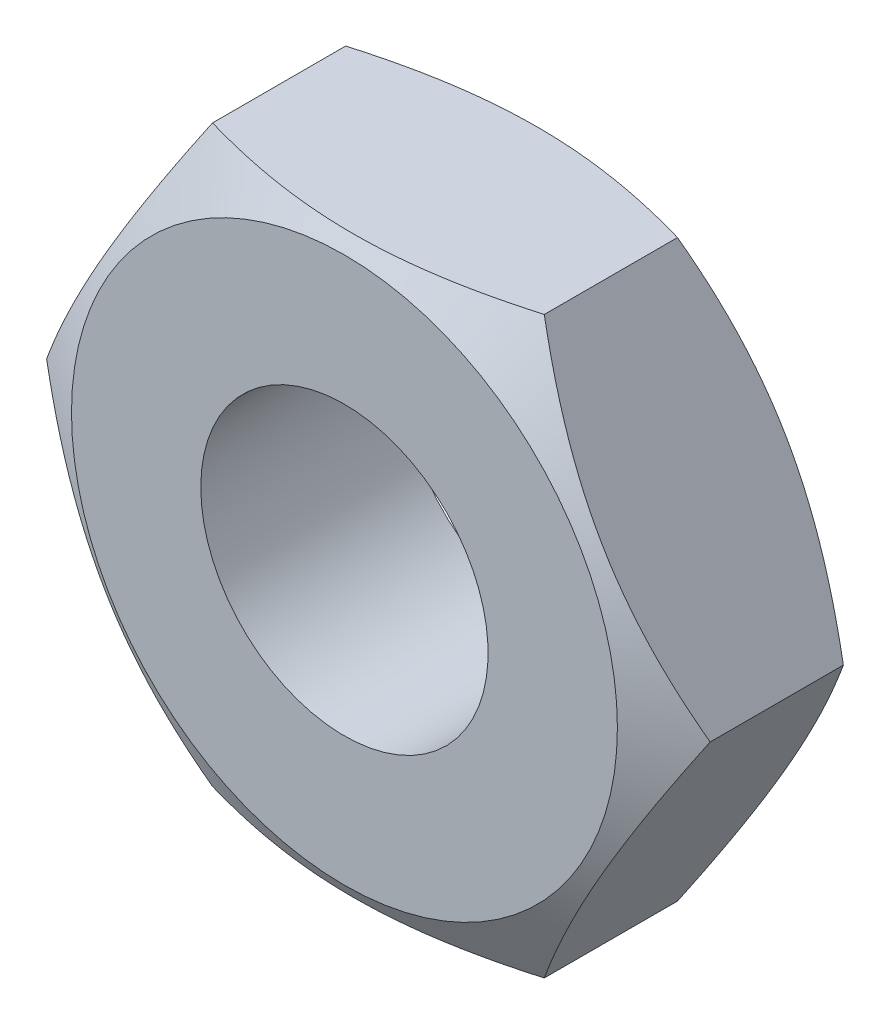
from build123d import *

# Parameters (mm, degrees)
BASE_EXTRUSION_DEPTH = 3.5
PER_AGE1_D           = 5


with BuildPart() as part:
    # Esquisse1 → Base-Extrusion (new body)
    with BuildSketch(Plane.XY):
        Polygon((-5.773502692, 0), (-2.886751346, 5), (2.886751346, 5), (5.773502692, 0), (2.886751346, -5), (-2.886751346, -5), align=None)
    extrude(amount=BASE_EXTRUSION_DEPTH)

    # Esquisse3 → Enlever de la mati_re-R_volution1 (revolve, cut)
    with BuildSketch(Plane(origin=(0, 0, 0), x_dir=(1, 0, 0), z_dir=(0, 1, 0))):
        Polygon((-4.75, 0), (-5.773502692, 0), (-5.773502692, -0.590919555), align=None)
    enlever_de_la_mati_re_r_volution1 = revolve(axis=Axis((0, 0, -2.852729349), (0, 0, 1)), mode=Mode.SUBTRACT)

    # Sym_trie1: Enlever de la mati_re-R_volution1 across plane
    add(enlever_de_la_mati_re_r_volution1.mirror(Plane(origin=(0, 0, 1.75), x_dir=(1, 0, 0), z_dir=(0, 0, -1))), mode=Mode.SUBTRACT)

    # Per_age1 (through all)
    with Locations(Plane(origin=(0, 0, 0), x_dir=(-1, 0, 0), z_dir=(0, 0, -1))):
        with Locations((0, 0)):
            Hole(PER_AGE1_D / 2)


solid = part.part
